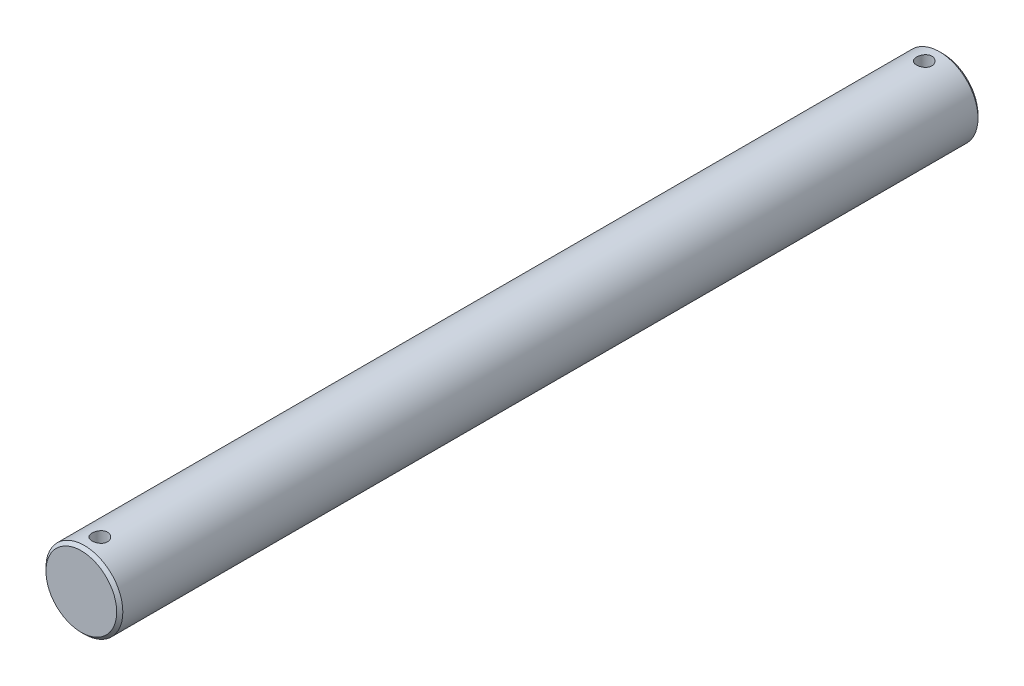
ISO-10303-21;
HEADER;
FILE_DESCRIPTION(('STEP AP214'),'2;1');
FILE_NAME('part.step','',(''),(''),'','','');
FILE_SCHEMA(('AUTOMOTIVE_DESIGN { 1 0 10303 214 1 1 1 1 }'));
ENDSEC;
DATA;
#1=APPLICATION_CONTEXT('core data for automotive mechanical design processes');
#2=APPLICATION_PROTOCOL_DEFINITION('international standard','automotive_design',2000,#1);
#3=PRODUCT_CONTEXT('',#1,'mechanical');
#4=PRODUCT('Part','Part','',(#3));
#5=PRODUCT_RELATED_PRODUCT_CATEGORY('part','',(#4));
#6=PRODUCT_DEFINITION_FORMATION('','',#4);
#7=PRODUCT_DEFINITION_CONTEXT('part definition',#1,'design');
#8=PRODUCT_DEFINITION('design','',#6,#7);
#9=PRODUCT_DEFINITION_SHAPE('','',#8);
#10=(LENGTH_UNIT() NAMED_UNIT(*) SI_UNIT(.MILLI.,.METRE.));
#11=(NAMED_UNIT(*) PLANE_ANGLE_UNIT() SI_UNIT($,.RADIAN.));
#12=(NAMED_UNIT(*) SI_UNIT($,.STERADIAN.) SOLID_ANGLE_UNIT());
#13=UNCERTAINTY_MEASURE_WITH_UNIT(LENGTH_MEASURE(1.E-05),#10,'distance_accuracy_value','');
#14=(GEOMETRIC_REPRESENTATION_CONTEXT(3) GLOBAL_UNCERTAINTY_ASSIGNED_CONTEXT((#13)) GLOBAL_UNIT_ASSIGNED_CONTEXT((#10,
#11,#12)) REPRESENTATION_CONTEXT('',''));
#15=CARTESIAN_POINT('',(0.,0.,0.));
#16=DIRECTION('',(0.,0.,1.));
#17=DIRECTION('',(1.,0.,0.));
#18=AXIS2_PLACEMENT_3D('',#15,#16,#17);
#19=CARTESIAN_POINT('',(0.,0.,140.));
#20=DIRECTION('',(0.,0.,-1.));
#21=DIRECTION('',(-1.,0.,0.));
#22=AXIS2_PLACEMENT_3D('',#19,#20,#21);
#23=CYLINDRICAL_SURFACE('',#22,12.5);
#24=CARTESIAN_POINT('',(0.,-12.5,136.5));
#25=CARTESIAN_POINT('',(0.138942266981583,-12.4999974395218,136.499994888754));
#26=CARTESIAN_POINT('',(0.277949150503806,-12.4976596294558,136.488377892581));
#27=CARTESIAN_POINT('',(0.552033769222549,-12.4885591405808,136.442253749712));
#28=CARTESIAN_POINT('',(0.687108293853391,-12.4817929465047,136.407728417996));
#29=CARTESIAN_POINT('',(0.949325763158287,-12.4645912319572,136.316896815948));
#30=CARTESIAN_POINT('',(1.07647616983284,-12.454159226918,136.260611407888));
#31=CARTESIAN_POINT('',(1.31951997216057,-12.4307599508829,136.127919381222));
#32=CARTESIAN_POINT('',(1.43541403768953,-12.4177928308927,136.051513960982));
#33=CARTESIAN_POINT('',(1.65423369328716,-12.3905541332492,135.879653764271));
#34=CARTESIAN_POINT('',(1.75698487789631,-12.3762686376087,135.783979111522));
#35=CARTESIAN_POINT('',(1.94509189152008,-12.3481045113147,135.576768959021));
#36=CARTESIAN_POINT('',(2.03044636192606,-12.3342259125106,135.465232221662));
#37=CARTESIAN_POINT('',(2.18207938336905,-12.3083110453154,135.22820951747));
#38=CARTESIAN_POINT('',(2.24817734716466,-12.2962926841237,135.102605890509));
#39=CARTESIAN_POINT('',(2.35826416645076,-12.2756567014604,134.84179545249));
#40=CARTESIAN_POINT('',(2.40225520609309,-12.267038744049,134.706589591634));
#41=CARTESIAN_POINT('',(2.46631324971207,-12.2543201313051,134.43228909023));
#42=CARTESIAN_POINT('',(2.48668624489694,-12.2501617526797,134.293268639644));
#43=CARTESIAN_POINT('',(2.5038803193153,-12.2466593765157,134.013725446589));
#44=CARTESIAN_POINT('',(2.50070380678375,-12.247314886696,133.8732028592));
#45=CARTESIAN_POINT('',(2.47113643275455,-12.2533137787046,133.596883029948));
#46=CARTESIAN_POINT('',(2.44509635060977,-12.2585863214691,133.461046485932));
#47=CARTESIAN_POINT('',(2.37109471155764,-12.273113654,133.195709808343));
#48=CARTESIAN_POINT('',(2.32313210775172,-12.2823686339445,133.066209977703));
#49=CARTESIAN_POINT('',(2.20631195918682,-12.3038904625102,132.816211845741));
#50=CARTESIAN_POINT('',(2.1373153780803,-12.3161772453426,132.695780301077));
#51=CARTESIAN_POINT('',(1.98048393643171,-12.3423654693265,132.468072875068));
#52=CARTESIAN_POINT('',(1.89264691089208,-12.3562670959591,132.360798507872));
#53=CARTESIAN_POINT('',(1.69874983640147,-12.3844255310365,132.160426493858));
#54=CARTESIAN_POINT('',(1.59239040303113,-12.3986842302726,132.067618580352));
#55=CARTESIAN_POINT('',(1.36546256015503,-12.4257212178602,131.901115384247));
#56=CARTESIAN_POINT('',(1.24489396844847,-12.4384994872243,131.827420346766));
#57=CARTESIAN_POINT('',(0.992648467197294,-12.4611672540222,131.701181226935));
#58=CARTESIAN_POINT('',(0.860954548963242,-12.4710522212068,131.648670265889));
#59=CARTESIAN_POINT('',(0.590372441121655,-12.4867852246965,131.566598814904));
#60=CARTESIAN_POINT('',(0.451485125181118,-12.4926337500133,131.537035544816));
#61=CARTESIAN_POINT('',(0.172948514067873,-12.4995667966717,131.502108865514));
#62=CARTESIAN_POINT('',(0.0333508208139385,-12.5007293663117,131.496348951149));
#63=CARTESIAN_POINT('',(-0.244812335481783,-12.4983762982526,131.508124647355));
#64=CARTESIAN_POINT('',(-0.383377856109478,-12.4948609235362,131.525658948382));
#65=CARTESIAN_POINT('',(-0.654264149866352,-12.4835958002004,131.58319593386));
#66=CARTESIAN_POINT('',(-0.786629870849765,-12.4758844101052,131.622995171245));
#67=CARTESIAN_POINT('',(-1.04280906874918,-12.4570888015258,131.72370995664));
#68=CARTESIAN_POINT('',(-1.16662190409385,-12.4460043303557,131.784627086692));
#69=CARTESIAN_POINT('',(-1.40385293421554,-12.4214977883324,131.926706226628));
#70=CARTESIAN_POINT('',(-1.51712531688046,-12.4080487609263,132.008106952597));
#71=CARTESIAN_POINT('',(-1.72854504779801,-12.3803683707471,132.188522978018));
#72=CARTESIAN_POINT('',(-1.8266907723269,-12.3661369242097,132.287540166));
#73=CARTESIAN_POINT('',(-2.00660147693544,-12.3382325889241,132.502183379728));
#74=CARTESIAN_POINT('',(-2.08809425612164,-12.3245715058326,132.618039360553));
#75=CARTESIAN_POINT('',(-2.23046355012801,-12.2996047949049,132.862028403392));
#76=CARTESIAN_POINT('',(-2.29134088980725,-12.2882990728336,132.990160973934));
#77=CARTESIAN_POINT('',(-2.39037960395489,-12.2694185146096,133.254420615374));
#78=CARTESIAN_POINT('',(-2.42865874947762,-12.2618243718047,133.390502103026));
#79=CARTESIAN_POINT('',(-2.48177162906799,-12.2511859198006,133.667333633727));
#80=CARTESIAN_POINT('',(-2.49660842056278,-12.2481410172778,133.808083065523));
#81=CARTESIAN_POINT('',(-2.50230227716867,-12.2469787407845,134.087522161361));
#82=CARTESIAN_POINT('',(-2.49358947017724,-12.2487729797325,134.226202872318));
#83=CARTESIAN_POINT('',(-2.45338076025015,-12.2568893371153,134.500079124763));
#84=CARTESIAN_POINT('',(-2.42188504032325,-12.2632114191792,134.635274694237));
#85=CARTESIAN_POINT('',(-2.33719642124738,-12.279631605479,134.898069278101));
#86=CARTESIAN_POINT('',(-2.28405626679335,-12.2897205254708,135.025685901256));
#87=CARTESIAN_POINT('',(-2.157636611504,-12.3125428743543,135.270259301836));
#88=CARTESIAN_POINT('',(-2.0843554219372,-12.3252765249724,135.387215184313));
#89=CARTESIAN_POINT('',(-1.91826478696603,-12.3522240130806,135.609288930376));
#90=CARTESIAN_POINT('',(-1.82514471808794,-12.3664593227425,135.714171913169));
#91=CARTESIAN_POINT('',(-1.62266092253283,-12.3946520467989,135.906965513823));
#92=CARTESIAN_POINT('',(-1.51329346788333,-12.4086093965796,135.994872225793));
#93=CARTESIAN_POINT('',(-1.28004407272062,-12.4348458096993,136.152086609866));
#94=CARTESIAN_POINT('',(-1.15602221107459,-12.4471057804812,136.2211900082));
#95=CARTESIAN_POINT('',(-0.897915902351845,-12.468378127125,136.337465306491));
#96=CARTESIAN_POINT('',(-0.763840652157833,-12.4773934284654,136.384656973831));
#97=CARTESIAN_POINT('',(-0.524553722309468,-12.4894093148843,136.446629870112));
#98=CARTESIAN_POINT('',(-0.42070416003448,-12.4933575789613,136.466607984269));
#99=CARTESIAN_POINT('',(-0.211248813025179,-12.4986538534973,136.493294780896));
#100=CARTESIAN_POINT('',(-0.105643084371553,-12.5000019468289,136.500003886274));
#101=CARTESIAN_POINT('',(0.,-12.5,136.5));
#102=B_SPLINE_CURVE_WITH_KNOTS('',3,(#24,#25,#26,#27,#28,#29,#30,#31,#32,#33,#34,#35,#36,#37,
#38,#39,#40,#41,#42,#43,#44,#45,#46,#47,#48,#49,#50,#51,#52,#53,#54,#55,#56,#57,#58,#59,#60,#61,
#62,#63,#64,#65,#66,#67,#68,#69,#70,#71,#72,#73,#74,#75,#76,#77,#78,#79,#80,#81,#82,#83,#84,#85,
#86,#87,#88,#89,#90,#91,#92,#93,#94,#95,#96,#97,#98,#99,#100,#101),.UNSPECIFIED.,.T.,.F.,(4,2,2,
2,2,2,2,2,2,2,2,2,2,2,2,2,2,2,2,2,2,2,2,2,2,2,2,2,2,2,2,2,2,2,2,2,2,2,4),(0.,0.416440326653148,
0.833211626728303,1.24958433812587,1.66593225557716,2.08733167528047,2.50876399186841,
2.93402987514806,3.3592537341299,3.77890462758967,4.19851260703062,4.61179317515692,
5.0250934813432,5.44118725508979,5.85732886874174,6.28095631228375,6.7045891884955,
7.12888187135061,7.5531231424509,7.97026839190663,8.38739019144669,8.80076134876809,
9.21416348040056,9.63262665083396,10.0511347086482,10.4760157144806,10.9008797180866,
11.3235095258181,11.7460842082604,12.1609930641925,12.5758985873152,12.9897990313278,
13.4037341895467,13.8247019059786,14.2457663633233,14.6712374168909,15.096323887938,
15.4129693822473,15.7296047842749),.UNSPECIFIED.);
#103=CARTESIAN_POINT('',(0.,-12.5,136.5));
#104=VERTEX_POINT('',#103);
#105=EDGE_CURVE('E33',#104,#104,#102,.T.);
#106=ORIENTED_EDGE('',*,*,#105,.T.);
#107=EDGE_LOOP('',(#106));
#108=FACE_BOUND('',#107,.T.);
#109=CARTESIAN_POINT('',(0.,12.5,136.5));
#110=CARTESIAN_POINT('',(-0.138942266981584,12.4999974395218,136.499994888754));
#111=CARTESIAN_POINT('',(-0.277949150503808,12.4976596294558,136.488377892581));
#112=CARTESIAN_POINT('',(-0.55203376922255,12.4885591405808,136.442253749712));
#113=CARTESIAN_POINT('',(-0.687108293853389,12.4817929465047,136.407728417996));
#114=CARTESIAN_POINT('',(-0.949325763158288,12.4645912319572,136.316896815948));
#115=CARTESIAN_POINT('',(-1.07647616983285,12.454159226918,136.260611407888));
#116=CARTESIAN_POINT('',(-1.31951997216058,12.4307599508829,136.127919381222));
#117=CARTESIAN_POINT('',(-1.43541403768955,12.4177928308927,136.051513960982));
#118=CARTESIAN_POINT('',(-1.65423369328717,12.3905541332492,135.879653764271));
#119=CARTESIAN_POINT('',(-1.75698487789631,12.3762686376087,135.783979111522));
#120=CARTESIAN_POINT('',(-1.94509189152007,12.3481045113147,135.576768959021));
#121=CARTESIAN_POINT('',(-2.03044636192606,12.3342259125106,135.465232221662));
#122=CARTESIAN_POINT('',(-2.18207938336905,12.3083110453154,135.22820951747));
#123=CARTESIAN_POINT('',(-2.24817734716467,12.2962926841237,135.102605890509));
#124=CARTESIAN_POINT('',(-2.35826416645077,12.2756567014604,134.84179545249));
#125=CARTESIAN_POINT('',(-2.40225520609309,12.267038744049,134.706589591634));
#126=CARTESIAN_POINT('',(-2.46631324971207,12.2543201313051,134.43228909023));
#127=CARTESIAN_POINT('',(-2.48668624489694,12.2501617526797,134.293268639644));
#128=CARTESIAN_POINT('',(-2.5038803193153,12.2466593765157,134.013725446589));
#129=CARTESIAN_POINT('',(-2.50070380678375,12.247314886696,133.8732028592));
#130=CARTESIAN_POINT('',(-2.47113643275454,12.2533137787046,133.596883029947));
#131=CARTESIAN_POINT('',(-2.44509635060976,12.2585863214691,133.461046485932));
#132=CARTESIAN_POINT('',(-2.37109471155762,12.273113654,133.195709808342));
#133=CARTESIAN_POINT('',(-2.3231321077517,12.2823686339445,133.066209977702));
#134=CARTESIAN_POINT('',(-2.20631195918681,12.3038904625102,132.816211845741));
#135=CARTESIAN_POINT('',(-2.13731537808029,12.3161772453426,132.695780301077));
#136=CARTESIAN_POINT('',(-1.98048393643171,12.3423654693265,132.468072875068));
#137=CARTESIAN_POINT('',(-1.89264691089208,12.3562670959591,132.360798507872));
#138=CARTESIAN_POINT('',(-1.69874983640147,12.3844255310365,132.160426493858));
#139=CARTESIAN_POINT('',(-1.59239040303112,12.3986842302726,132.067618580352));
#140=CARTESIAN_POINT('',(-1.36546256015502,12.4257212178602,131.901115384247));
#141=CARTESIAN_POINT('',(-1.24489396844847,12.4384994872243,131.827420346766));
#142=CARTESIAN_POINT('',(-0.992648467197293,12.4611672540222,131.701181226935));
#143=CARTESIAN_POINT('',(-0.860954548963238,12.4710522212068,131.648670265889));
#144=CARTESIAN_POINT('',(-0.590372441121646,12.4867852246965,131.566598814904));
#145=CARTESIAN_POINT('',(-0.451485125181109,12.4926337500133,131.537035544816));
#146=CARTESIAN_POINT('',(-0.172948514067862,12.4995667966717,131.502108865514));
#147=CARTESIAN_POINT('',(-0.0333508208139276,12.5007293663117,131.496348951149));
#148=CARTESIAN_POINT('',(0.244812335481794,12.4983762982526,131.508124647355));
#149=CARTESIAN_POINT('',(0.383377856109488,12.4948609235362,131.525658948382));
#150=CARTESIAN_POINT('',(0.654264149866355,12.4835958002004,131.58319593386));
#151=CARTESIAN_POINT('',(0.786629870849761,12.4758844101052,131.622995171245));
#152=CARTESIAN_POINT('',(1.04280906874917,12.4570888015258,131.72370995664));
#153=CARTESIAN_POINT('',(1.16662190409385,12.4460043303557,131.784627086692));
#154=CARTESIAN_POINT('',(1.40385293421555,12.4214977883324,131.926706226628));
#155=CARTESIAN_POINT('',(1.51712531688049,12.4080487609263,132.008106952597));
#156=CARTESIAN_POINT('',(1.72854504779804,12.3803683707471,132.188522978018));
#157=CARTESIAN_POINT('',(1.82669077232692,12.3661369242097,132.287540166));
#158=CARTESIAN_POINT('',(2.00660147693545,12.3382325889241,132.502183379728));
#159=CARTESIAN_POINT('',(2.08809425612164,12.3245715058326,132.618039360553));
#160=CARTESIAN_POINT('',(2.23046355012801,12.2996047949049,132.862028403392));
#161=CARTESIAN_POINT('',(2.29134088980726,12.2882990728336,132.990160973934));
#162=CARTESIAN_POINT('',(2.39037960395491,12.2694185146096,133.254420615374));
#163=CARTESIAN_POINT('',(2.42865874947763,12.2618243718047,133.390502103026));
#164=CARTESIAN_POINT('',(2.481771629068,12.2511859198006,133.667333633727));
#165=CARTESIAN_POINT('',(2.49660842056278,12.2481410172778,133.808083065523));
#166=CARTESIAN_POINT('',(2.50230227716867,12.2469787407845,134.087522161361));
#167=CARTESIAN_POINT('',(2.49358947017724,12.2487729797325,134.226202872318));
#168=CARTESIAN_POINT('',(2.45338076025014,12.2568893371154,134.500079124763));
#169=CARTESIAN_POINT('',(2.42188504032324,12.2632114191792,134.635274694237));
#170=CARTESIAN_POINT('',(2.33719642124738,12.279631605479,134.898069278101));
#171=CARTESIAN_POINT('',(2.28405626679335,12.2897205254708,135.025685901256));
#172=CARTESIAN_POINT('',(2.157636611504,12.3125428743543,135.270259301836));
#173=CARTESIAN_POINT('',(2.0843554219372,12.3252765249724,135.387215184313));
#174=CARTESIAN_POINT('',(1.91826478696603,12.3522240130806,135.609288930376));
#175=CARTESIAN_POINT('',(1.82514471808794,12.3664593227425,135.714171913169));
#176=CARTESIAN_POINT('',(1.62266092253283,12.3946520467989,135.906965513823));
#177=CARTESIAN_POINT('',(1.51329346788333,12.4086093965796,135.994872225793));
#178=CARTESIAN_POINT('',(1.28004407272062,12.4348458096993,136.152086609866));
#179=CARTESIAN_POINT('',(1.15602221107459,12.4471057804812,136.2211900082));
#180=CARTESIAN_POINT('',(0.897915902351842,12.468378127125,136.337465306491));
#181=CARTESIAN_POINT('',(0.763840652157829,12.4773934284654,136.384656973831));
#182=CARTESIAN_POINT('',(0.524553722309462,12.4894093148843,136.446629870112));
#183=CARTESIAN_POINT('',(0.420704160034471,12.4933575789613,136.466607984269));
#184=CARTESIAN_POINT('',(0.211248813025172,12.4986538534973,136.493294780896));
#185=CARTESIAN_POINT('',(0.10564308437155,12.5000019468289,136.500003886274));
#186=CARTESIAN_POINT('',(0.,12.5,136.5));
#187=B_SPLINE_CURVE_WITH_KNOTS('',3,(#109,#110,#111,#112,#113,#114,#115,#116,#117,#118,#119,
#120,#121,#122,#123,#124,#125,#126,#127,#128,#129,#130,#131,#132,#133,#134,#135,#136,#137,#138,
#139,#140,#141,#142,#143,#144,#145,#146,#147,#148,#149,#150,#151,#152,#153,#154,#155,#156,#157,
#158,#159,#160,#161,#162,#163,#164,#165,#166,#167,#168,#169,#170,#171,#172,#173,#174,#175,#176,
#177,#178,#179,#180,#181,#182,#183,#184,#185,#186),.UNSPECIFIED.,.T.,.F.,(4,2,2,2,2,2,2,2,2,2,2,
2,2,2,2,2,2,2,2,2,2,2,2,2,2,2,2,2,2,2,2,2,2,2,2,2,2,2,4),(0.,0.416440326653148,
0.833211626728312,1.24958433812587,1.66593225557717,2.08733167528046,2.50876399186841,
2.93402987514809,3.35925373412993,3.77890462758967,4.19851260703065,4.611793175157,
5.02509348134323,5.44118725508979,5.85732886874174,6.28095631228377,6.70458918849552,
7.12888187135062,7.55312314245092,7.97026839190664,8.3873901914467,8.80076134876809,
9.21416348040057,9.63262665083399,10.0511347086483,10.4760157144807,10.9008797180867,
11.3235095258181,11.7460842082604,12.1609930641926,12.5758985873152,12.9897990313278,
13.4037341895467,13.8247019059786,14.2457663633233,14.6712374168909,15.096323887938,
15.4129693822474,15.7296047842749),.UNSPECIFIED.);
#188=CARTESIAN_POINT('',(0.,12.5,136.5));
#189=VERTEX_POINT('',#188);
#190=EDGE_CURVE('E107',#189,#189,#187,.T.);
#191=ORIENTED_EDGE('',*,*,#190,.T.);
#192=EDGE_LOOP('',(#191));
#193=FACE_BOUND('',#192,.T.);
#194=CARTESIAN_POINT('',(0.,-12.5,-131.5));
#195=CARTESIAN_POINT('',(0.138942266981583,-12.4999974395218,-131.500005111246));
#196=CARTESIAN_POINT('',(0.277949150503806,-12.4976596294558,-131.511622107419));
#197=CARTESIAN_POINT('',(0.55203376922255,-12.4885591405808,-131.557746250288));
#198=CARTESIAN_POINT('',(0.687108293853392,-12.4817929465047,-131.592271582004));
#199=CARTESIAN_POINT('',(0.949325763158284,-12.4645912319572,-131.683103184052));
#200=CARTESIAN_POINT('',(1.07647616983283,-12.454159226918,-131.739388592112));
#201=CARTESIAN_POINT('',(1.31951997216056,-12.4307599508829,-131.872080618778));
#202=CARTESIAN_POINT('',(1.43541403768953,-12.4177928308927,-131.948486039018));
#203=CARTESIAN_POINT('',(1.65423369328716,-12.3905541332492,-132.120346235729));
#204=CARTESIAN_POINT('',(1.75698487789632,-12.3762686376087,-132.216020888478));
#205=CARTESIAN_POINT('',(1.94509189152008,-12.3481045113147,-132.423231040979));
#206=CARTESIAN_POINT('',(2.03044636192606,-12.3342259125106,-132.534767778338));
#207=CARTESIAN_POINT('',(2.18207938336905,-12.3083110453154,-132.77179048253));
#208=CARTESIAN_POINT('',(2.24817734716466,-12.2962926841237,-132.897394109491));
#209=CARTESIAN_POINT('',(2.35826416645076,-12.2756567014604,-133.15820454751));
#210=CARTESIAN_POINT('',(2.40225520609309,-12.267038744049,-133.293410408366));
#211=CARTESIAN_POINT('',(2.46631324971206,-12.2543201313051,-133.56771090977));
#212=CARTESIAN_POINT('',(2.48668624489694,-12.2501617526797,-133.706731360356));
#213=CARTESIAN_POINT('',(2.5038803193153,-12.2466593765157,-133.986274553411));
#214=CARTESIAN_POINT('',(2.50070380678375,-12.247314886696,-134.1267971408));
#215=CARTESIAN_POINT('',(2.47113643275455,-12.2533137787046,-134.403116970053));
#216=CARTESIAN_POINT('',(2.44509635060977,-12.2585863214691,-134.538953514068));
#217=CARTESIAN_POINT('',(2.37109471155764,-12.273113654,-134.804290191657));
#218=CARTESIAN_POINT('',(2.32313210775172,-12.2823686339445,-134.933790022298));
#219=CARTESIAN_POINT('',(2.20631195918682,-12.3038904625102,-135.183788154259));
#220=CARTESIAN_POINT('',(2.1373153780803,-12.3161772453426,-135.304219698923));
#221=CARTESIAN_POINT('',(1.98048393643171,-12.3423654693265,-135.531927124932));
#222=CARTESIAN_POINT('',(1.89264691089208,-12.3562670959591,-135.639201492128));
#223=CARTESIAN_POINT('',(1.69874983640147,-12.3844255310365,-135.839573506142));
#224=CARTESIAN_POINT('',(1.59239040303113,-12.3986842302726,-135.932381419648));
#225=CARTESIAN_POINT('',(1.36546256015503,-12.4257212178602,-136.098884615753));
#226=CARTESIAN_POINT('',(1.24489396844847,-12.4384994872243,-136.172579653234));
#227=CARTESIAN_POINT('',(0.992648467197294,-12.4611672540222,-136.298818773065));
#228=CARTESIAN_POINT('',(0.860954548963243,-12.4710522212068,-136.351329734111));
#229=CARTESIAN_POINT('',(0.590372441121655,-12.4867852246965,-136.433401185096));
#230=CARTESIAN_POINT('',(0.451485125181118,-12.4926337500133,-136.462964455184));
#231=CARTESIAN_POINT('',(0.172948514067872,-12.4995667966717,-136.497891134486));
#232=CARTESIAN_POINT('',(0.0333508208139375,-12.5007293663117,-136.503651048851));
#233=CARTESIAN_POINT('',(-0.244812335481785,-12.4983762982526,-136.491875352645));
#234=CARTESIAN_POINT('',(-0.383377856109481,-12.4948609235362,-136.474341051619));
#235=CARTESIAN_POINT('',(-0.654264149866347,-12.4835958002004,-136.41680406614));
#236=CARTESIAN_POINT('',(-0.786629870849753,-12.4758844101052,-136.377004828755));
#237=CARTESIAN_POINT('',(-1.04280906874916,-12.4570888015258,-136.276290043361));
#238=CARTESIAN_POINT('',(-1.16662190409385,-12.4460043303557,-136.215372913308));
#239=CARTESIAN_POINT('',(-1.40385293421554,-12.4214977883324,-136.073293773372));
#240=CARTESIAN_POINT('',(-1.51712531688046,-12.4080487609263,-135.991893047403));
#241=CARTESIAN_POINT('',(-1.72854504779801,-12.3803683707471,-135.811477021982));
#242=CARTESIAN_POINT('',(-1.8266907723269,-12.3661369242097,-135.712459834));
#243=CARTESIAN_POINT('',(-2.00660147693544,-12.3382325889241,-135.497816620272));
#244=CARTESIAN_POINT('',(-2.08809425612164,-12.3245715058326,-135.381960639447));
#245=CARTESIAN_POINT('',(-2.23046355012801,-12.2996047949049,-135.137971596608));
#246=CARTESIAN_POINT('',(-2.29134088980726,-12.2882990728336,-135.009839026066));
#247=CARTESIAN_POINT('',(-2.3903796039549,-12.2694185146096,-134.745579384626));
#248=CARTESIAN_POINT('',(-2.42865874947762,-12.2618243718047,-134.609497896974));
#249=CARTESIAN_POINT('',(-2.48177162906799,-12.2511859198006,-134.332666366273));
#250=CARTESIAN_POINT('',(-2.49660842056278,-12.2481410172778,-134.191916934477));
#251=CARTESIAN_POINT('',(-2.50230227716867,-12.2469787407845,-133.912477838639));
#252=CARTESIAN_POINT('',(-2.49358947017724,-12.2487729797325,-133.773797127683));
#253=CARTESIAN_POINT('',(-2.45338076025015,-12.2568893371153,-133.499920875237));
#254=CARTESIAN_POINT('',(-2.42188504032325,-12.2632114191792,-133.364725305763));
#255=CARTESIAN_POINT('',(-2.33719642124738,-12.279631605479,-133.101930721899));
#256=CARTESIAN_POINT('',(-2.28405626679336,-12.2897205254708,-132.974314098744));
#257=CARTESIAN_POINT('',(-2.15763661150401,-12.3125428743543,-132.729740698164));
#258=CARTESIAN_POINT('',(-2.08435542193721,-12.3252765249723,-132.612784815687));
#259=CARTESIAN_POINT('',(-1.91826478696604,-12.3522240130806,-132.390711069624));
#260=CARTESIAN_POINT('',(-1.82514471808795,-12.3664593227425,-132.285828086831));
#261=CARTESIAN_POINT('',(-1.62266092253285,-12.3946520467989,-132.093034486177));
#262=CARTESIAN_POINT('',(-1.51329346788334,-12.4086093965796,-132.005127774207));
#263=CARTESIAN_POINT('',(-1.28004407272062,-12.4348458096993,-131.847913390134));
#264=CARTESIAN_POINT('',(-1.15602221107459,-12.4471057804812,-131.7788099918));
#265=CARTESIAN_POINT('',(-0.897915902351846,-12.468378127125,-131.662534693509));
#266=CARTESIAN_POINT('',(-0.763840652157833,-12.4773934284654,-131.615343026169));
#267=CARTESIAN_POINT('',(-0.524553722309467,-12.4894093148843,-131.553370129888));
#268=CARTESIAN_POINT('',(-0.420704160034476,-12.4933575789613,-131.533392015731));
#269=CARTESIAN_POINT('',(-0.211248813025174,-12.4986538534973,-131.506705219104));
#270=CARTESIAN_POINT('',(-0.105643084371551,-12.5000019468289,-131.499996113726));
#271=CARTESIAN_POINT('',(0.,-12.5,-131.5));
#272=B_SPLINE_CURVE_WITH_KNOTS('',3,(#194,#195,#196,#197,#198,#199,#200,#201,#202,#203,#204,
#205,#206,#207,#208,#209,#210,#211,#212,#213,#214,#215,#216,#217,#218,#219,#220,#221,#222,#223,
#224,#225,#226,#227,#228,#229,#230,#231,#232,#233,#234,#235,#236,#237,#238,#239,#240,#241,#242,
#243,#244,#245,#246,#247,#248,#249,#250,#251,#252,#253,#254,#255,#256,#257,#258,#259,#260,#261,
#262,#263,#264,#265,#266,#267,#268,#269,#270,#271),.UNSPECIFIED.,.T.,.F.,(4,2,2,2,2,2,2,2,2,2,2,
2,2,2,2,2,2,2,2,2,2,2,2,2,2,2,2,2,2,2,2,2,2,2,2,2,2,2,4),(0.,0.416440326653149,
0.833211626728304,1.24958433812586,1.66593225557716,2.08733167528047,2.50876399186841,
2.93402987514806,3.3592537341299,3.77890462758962,4.19851260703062,4.61179317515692,
5.0250934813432,5.44118725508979,5.85732886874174,6.28095631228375,6.7045891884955,
7.12888187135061,7.55312314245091,7.97026839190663,8.38739019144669,8.80076134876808,
9.21416348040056,9.63262665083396,10.0511347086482,10.4760157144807,10.9008797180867,
11.3235095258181,11.7460842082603,12.1609930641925,12.5758985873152,12.9897990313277,
13.4037341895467,13.8247019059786,14.2457663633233,14.6712374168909,15.096323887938,
15.4129693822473,15.7296047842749),.UNSPECIFIED.);
#273=CARTESIAN_POINT('',(0.,-12.5,-131.5));
#274=VERTEX_POINT('',#273);
#275=EDGE_CURVE('E55',#274,#274,#272,.T.);
#276=ORIENTED_EDGE('',*,*,#275,.T.);
#277=EDGE_LOOP('',(#276));
#278=FACE_BOUND('',#277,.T.);
#279=CARTESIAN_POINT('',(0.,12.5,-131.5));
#280=CARTESIAN_POINT('',(-0.138942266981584,12.4999974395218,-131.500005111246));
#281=CARTESIAN_POINT('',(-0.277949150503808,12.4976596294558,-131.511622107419));
#282=CARTESIAN_POINT('',(-0.552033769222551,12.4885591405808,-131.557746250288));
#283=CARTESIAN_POINT('',(-0.687108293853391,12.4817929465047,-131.592271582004));
#284=CARTESIAN_POINT('',(-0.949325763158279,12.4645912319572,-131.683103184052));
#285=CARTESIAN_POINT('',(-1.07647616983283,12.454159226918,-131.739388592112));
#286=CARTESIAN_POINT('',(-1.31951997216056,12.4307599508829,-131.872080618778));
#287=CARTESIAN_POINT('',(-1.43541403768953,12.4177928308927,-131.948486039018));
#288=CARTESIAN_POINT('',(-1.65423369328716,12.3905541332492,-132.120346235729));
#289=CARTESIAN_POINT('',(-1.75698487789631,12.3762686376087,-132.216020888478));
#290=CARTESIAN_POINT('',(-1.94509189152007,12.3481045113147,-132.423231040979));
#291=CARTESIAN_POINT('',(-2.03044636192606,12.3342259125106,-132.534767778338));
#292=CARTESIAN_POINT('',(-2.18207938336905,12.3083110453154,-132.77179048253));
#293=CARTESIAN_POINT('',(-2.24817734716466,12.2962926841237,-132.897394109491));
#294=CARTESIAN_POINT('',(-2.35826416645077,12.2756567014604,-133.15820454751));
#295=CARTESIAN_POINT('',(-2.40225520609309,12.267038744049,-133.293410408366));
#296=CARTESIAN_POINT('',(-2.46631324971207,12.2543201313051,-133.56771090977));
#297=CARTESIAN_POINT('',(-2.48668624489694,12.2501617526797,-133.706731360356));
#298=CARTESIAN_POINT('',(-2.5038803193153,12.2466593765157,-133.986274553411));
#299=CARTESIAN_POINT('',(-2.50070380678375,12.247314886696,-134.1267971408));
#300=CARTESIAN_POINT('',(-2.47113643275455,12.2533137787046,-134.403116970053));
#301=CARTESIAN_POINT('',(-2.44509635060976,12.2585863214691,-134.538953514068));
#302=CARTESIAN_POINT('',(-2.37109471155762,12.273113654,-134.804290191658));
#303=CARTESIAN_POINT('',(-2.3231321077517,12.2823686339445,-134.933790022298));
#304=CARTESIAN_POINT('',(-2.20631195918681,12.3038904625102,-135.183788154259));
#305=CARTESIAN_POINT('',(-2.13731537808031,12.3161772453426,-135.304219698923));
#306=CARTESIAN_POINT('',(-1.98048393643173,12.3423654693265,-135.531927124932));
#307=CARTESIAN_POINT('',(-1.89264691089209,12.3562670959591,-135.639201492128));
#308=CARTESIAN_POINT('',(-1.69874983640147,12.3844255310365,-135.839573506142));
#309=CARTESIAN_POINT('',(-1.59239040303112,12.3986842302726,-135.932381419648));
#310=CARTESIAN_POINT('',(-1.36546256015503,12.4257212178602,-136.098884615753));
#311=CARTESIAN_POINT('',(-1.24489396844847,12.4384994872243,-136.172579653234));
#312=CARTESIAN_POINT('',(-0.992648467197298,12.4611672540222,-136.298818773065));
#313=CARTESIAN_POINT('',(-0.860954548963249,12.4710522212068,-136.351329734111));
#314=CARTESIAN_POINT('',(-0.590372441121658,12.4867852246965,-136.433401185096));
#315=CARTESIAN_POINT('',(-0.451485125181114,12.4926337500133,-136.462964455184));
#316=CARTESIAN_POINT('',(-0.172948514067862,12.4995667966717,-136.497891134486));
#317=CARTESIAN_POINT('',(-0.0333508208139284,12.5007293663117,-136.503651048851));
#318=CARTESIAN_POINT('',(0.244812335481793,12.4983762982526,-136.491875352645));
#319=CARTESIAN_POINT('',(0.383377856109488,12.4948609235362,-136.474341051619));
#320=CARTESIAN_POINT('',(0.654264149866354,12.4835958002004,-136.41680406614));
#321=CARTESIAN_POINT('',(0.786629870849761,12.4758844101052,-136.377004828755));
#322=CARTESIAN_POINT('',(1.04280906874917,12.4570888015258,-136.276290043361));
#323=CARTESIAN_POINT('',(1.16662190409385,12.4460043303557,-136.215372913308));
#324=CARTESIAN_POINT('',(1.40385293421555,12.4214977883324,-136.073293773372));
#325=CARTESIAN_POINT('',(1.51712531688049,12.4080487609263,-135.991893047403));
#326=CARTESIAN_POINT('',(1.72854504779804,12.3803683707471,-135.811477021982));
#327=CARTESIAN_POINT('',(1.82669077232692,12.3661369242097,-135.712459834));
#328=CARTESIAN_POINT('',(2.00660147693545,12.3382325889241,-135.497816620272));
#329=CARTESIAN_POINT('',(2.08809425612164,12.3245715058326,-135.381960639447));
#330=CARTESIAN_POINT('',(2.23046355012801,12.2996047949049,-135.137971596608));
#331=CARTESIAN_POINT('',(2.29134088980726,12.2882990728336,-135.009839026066));
#332=CARTESIAN_POINT('',(2.39037960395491,12.2694185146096,-134.745579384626));
#333=CARTESIAN_POINT('',(2.42865874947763,12.2618243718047,-134.609497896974));
#334=CARTESIAN_POINT('',(2.481771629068,12.2511859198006,-134.332666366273));
#335=CARTESIAN_POINT('',(2.49660842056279,12.2481410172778,-134.191916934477));
#336=CARTESIAN_POINT('',(2.50230227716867,12.2469787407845,-133.912477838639));
#337=CARTESIAN_POINT('',(2.49358947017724,12.2487729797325,-133.773797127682));
#338=CARTESIAN_POINT('',(2.45338076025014,12.2568893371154,-133.499920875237));
#339=CARTESIAN_POINT('',(2.42188504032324,12.2632114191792,-133.364725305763));
#340=CARTESIAN_POINT('',(2.33719642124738,12.279631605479,-133.101930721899));
#341=CARTESIAN_POINT('',(2.28405626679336,12.2897205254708,-132.974314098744));
#342=CARTESIAN_POINT('',(2.15763661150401,12.3125428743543,-132.729740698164));
#343=CARTESIAN_POINT('',(2.08435542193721,12.3252765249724,-132.612784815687));
#344=CARTESIAN_POINT('',(1.91826478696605,12.3522240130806,-132.390711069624));
#345=CARTESIAN_POINT('',(1.82514471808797,12.3664593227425,-132.285828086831));
#346=CARTESIAN_POINT('',(1.62266092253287,12.3946520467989,-132.093034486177));
#347=CARTESIAN_POINT('',(1.51329346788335,12.4086093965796,-132.005127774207));
#348=CARTESIAN_POINT('',(1.28004407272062,12.4348458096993,-131.847913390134));
#349=CARTESIAN_POINT('',(1.15602221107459,12.4471057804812,-131.7788099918));
#350=CARTESIAN_POINT('',(0.897915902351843,12.468378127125,-131.662534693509));
#351=CARTESIAN_POINT('',(0.76384065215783,12.4773934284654,-131.615343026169));
#352=CARTESIAN_POINT('',(0.524553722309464,12.4894093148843,-131.553370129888));
#353=CARTESIAN_POINT('',(0.420704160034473,12.4933575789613,-131.533392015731));
#354=CARTESIAN_POINT('',(0.211248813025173,12.4986538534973,-131.506705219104));
#355=CARTESIAN_POINT('',(0.105643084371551,12.5000019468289,-131.499996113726));
#356=CARTESIAN_POINT('',(0.,12.5,-131.5));
#357=B_SPLINE_CURVE_WITH_KNOTS('',3,(#279,#280,#281,#282,#283,#284,#285,#286,#287,#288,#289,
#290,#291,#292,#293,#294,#295,#296,#297,#298,#299,#300,#301,#302,#303,#304,#305,#306,#307,#308,
#309,#310,#311,#312,#313,#314,#315,#316,#317,#318,#319,#320,#321,#322,#323,#324,#325,#326,#327,
#328,#329,#330,#331,#332,#333,#334,#335,#336,#337,#338,#339,#340,#341,#342,#343,#344,#345,#346,
#347,#348,#349,#350,#351,#352,#353,#354,#355,#356),.UNSPECIFIED.,.T.,.F.,(4,2,2,2,2,2,2,2,2,2,2,
2,2,2,2,2,2,2,2,2,2,2,2,2,2,2,2,2,2,2,2,2,2,2,2,2,2,2,4),(0.,0.416440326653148,
0.833211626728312,1.24958433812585,1.66593225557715,2.08733167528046,2.50876399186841,
2.93402987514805,3.35925373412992,3.77890462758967,4.19851260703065,4.61179317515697,
5.02509348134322,5.44118725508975,5.85732886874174,6.28095631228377,6.70458918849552,
7.1288818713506,7.55312314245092,7.97026839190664,8.3873901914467,8.80076134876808,
9.21416348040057,9.63262665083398,10.0511347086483,10.4760157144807,10.9008797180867,
11.3235095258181,11.7460842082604,12.1609930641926,12.5758985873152,12.9897990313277,
13.4037341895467,13.8247019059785,14.2457663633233,14.6712374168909,15.096323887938,
15.4129693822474,15.7296047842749),.UNSPECIFIED.);
#358=CARTESIAN_POINT('',(0.,12.5,-131.5));
#359=VERTEX_POINT('',#358);
#360=EDGE_CURVE('E49',#359,#359,#357,.T.);
#361=ORIENTED_EDGE('',*,*,#360,.T.);
#362=EDGE_LOOP('',(#361));
#363=FACE_BOUND('',#362,.T.);
#364=CARTESIAN_POINT('',(0.,0.,139.));
#365=DIRECTION('',(0.,0.,1.));
#366=DIRECTION('',(1.,0.,0.));
#367=AXIS2_PLACEMENT_3D('',#364,#365,#366);
#368=CIRCLE('',#367,12.5);
#369=CARTESIAN_POINT('',(12.5,0.,139.));
#370=VERTEX_POINT('',#369);
#371=EDGE_CURVE('E40',#370,#370,#368,.F.);
#372=ORIENTED_EDGE('',*,*,#371,.T.);
#373=EDGE_LOOP('',(#372));
#374=FACE_BOUND('',#373,.T.);
#375=CARTESIAN_POINT('',(0.,0.,-139.));
#376=DIRECTION('',(0.,0.,1.));
#377=DIRECTION('',(1.,0.,0.));
#378=AXIS2_PLACEMENT_3D('',#375,#376,#377);
#379=CIRCLE('',#378,12.5);
#380=CARTESIAN_POINT('',(12.5,0.,-139.));
#381=VERTEX_POINT('',#380);
#382=EDGE_CURVE('E45',#381,#381,#379,.T.);
#383=ORIENTED_EDGE('',*,*,#382,.T.);
#384=EDGE_LOOP('',(#383));
#385=FACE_BOUND('',#384,.T.);
#386=ADVANCED_FACE('F29',(#108,#193,#278,#363,#374,#385),#23,.T.);
#387=CARTESIAN_POINT('',(0.,0.,140.));
#388=DIRECTION('',(0.,0.,1.));
#389=DIRECTION('',(1.,0.,0.));
#390=AXIS2_PLACEMENT_3D('',#387,#388,#389);
#391=PLANE('',#390);
#392=CARTESIAN_POINT('',(0.,0.,140.));
#393=DIRECTION('',(0.,0.,1.));
#394=DIRECTION('',(1.,0.,0.));
#395=AXIS2_PLACEMENT_3D('',#392,#393,#394);
#396=CIRCLE('',#395,11.5);
#397=CARTESIAN_POINT('',(11.5,0.,140.));
#398=VERTEX_POINT('',#397);
#399=EDGE_CURVE('E85',#398,#398,#396,.T.);
#400=ORIENTED_EDGE('',*,*,#399,.T.);
#401=EDGE_LOOP('',(#400));
#402=FACE_BOUND('',#401,.T.);
#403=ADVANCED_FACE('F76',(#402),#391,.T.);
#404=CARTESIAN_POINT('',(0.,0.,-140.));
#405=DIRECTION('',(0.,0.,1.));
#406=DIRECTION('',(1.,0.,0.));
#407=AXIS2_PLACEMENT_3D('',#404,#405,#406);
#408=PLANE('',#407);
#409=CARTESIAN_POINT('',(0.,0.,-140.));
#410=DIRECTION('',(0.,0.,1.));
#411=DIRECTION('',(1.,0.,0.));
#412=AXIS2_PLACEMENT_3D('',#409,#410,#411);
#413=CIRCLE('',#412,11.5);
#414=CARTESIAN_POINT('',(11.5,0.,-140.));
#415=VERTEX_POINT('',#414);
#416=EDGE_CURVE('E10',#415,#415,#413,.F.);
#417=ORIENTED_EDGE('',*,*,#416,.T.);
#418=EDGE_LOOP('',(#417));
#419=FACE_BOUND('',#418,.T.);
#420=ADVANCED_FACE('F73',(#419),#408,.F.);
#421=CARTESIAN_POINT('',(0.,0.,140.));
#422=DIRECTION('',(0.,0.,-1.));
#423=DIRECTION('',(-1.,0.,0.));
#424=AXIS2_PLACEMENT_3D('',#421,#422,#423);
#425=CONICAL_SURFACE('',#424,11.5,0.785398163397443);
#426=ORIENTED_EDGE('',*,*,#371,.F.);
#427=EDGE_LOOP('',(#426));
#428=FACE_BOUND('',#427,.T.);
#429=ORIENTED_EDGE('',*,*,#399,.F.);
#430=EDGE_LOOP('',(#429));
#431=FACE_BOUND('',#430,.T.);
#432=ADVANCED_FACE('F69',(#428,#431),#425,.T.);
#433=CARTESIAN_POINT('',(0.,0.,-139.));
#434=DIRECTION('',(0.,0.,1.));
#435=DIRECTION('',(1.,0.,0.));
#436=AXIS2_PLACEMENT_3D('',#433,#434,#435);
#437=CONICAL_SURFACE('',#436,12.5,0.785398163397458);
#438=ORIENTED_EDGE('',*,*,#416,.F.);
#439=EDGE_LOOP('',(#438));
#440=FACE_BOUND('',#439,.T.);
#441=ORIENTED_EDGE('',*,*,#382,.F.);
#442=EDGE_LOOP('',(#441));
#443=FACE_BOUND('',#442,.T.);
#444=ADVANCED_FACE('F63',(#440,#443),#437,.T.);
#445=CARTESIAN_POINT('',(0.,-61.,-134.));
#446=DIRECTION('',(0.,1.,0.));
#447=DIRECTION('',(0.,0.,1.));
#448=AXIS2_PLACEMENT_3D('',#445,#446,#447);
#449=CYLINDRICAL_SURFACE('',#448,2.5);
#450=ORIENTED_EDGE('',*,*,#360,.F.);
#451=EDGE_LOOP('',(#450));
#452=FACE_BOUND('',#451,.T.);
#453=ORIENTED_EDGE('',*,*,#275,.F.);
#454=EDGE_LOOP('',(#453));
#455=FACE_BOUND('',#454,.T.);
#456=ADVANCED_FACE('F58',(#452,#455),#449,.F.);
#457=CARTESIAN_POINT('',(0.,-61.,134.));
#458=DIRECTION('',(0.,1.,0.));
#459=DIRECTION('',(0.,0.,1.));
#460=AXIS2_PLACEMENT_3D('',#457,#458,#459);
#461=CYLINDRICAL_SURFACE('',#460,2.5);
#462=ORIENTED_EDGE('',*,*,#190,.F.);
#463=EDGE_LOOP('',(#462));
#464=FACE_BOUND('',#463,.T.);
#465=ORIENTED_EDGE('',*,*,#105,.F.);
#466=EDGE_LOOP('',(#465));
#467=FACE_BOUND('',#466,.T.);
#468=ADVANCED_FACE('F62',(#464,#467),#461,.F.);
#469=CLOSED_SHELL('',(#386,#403,#420,#432,#444,#456,#468));
#470=MANIFOLD_SOLID_BREP('B2',#469);
#471=ADVANCED_BREP_SHAPE_REPRESENTATION('',(#18,#470),#14);
#472=SHAPE_DEFINITION_REPRESENTATION(#9,#471);
ENDSEC;
END-ISO-10303-21;
